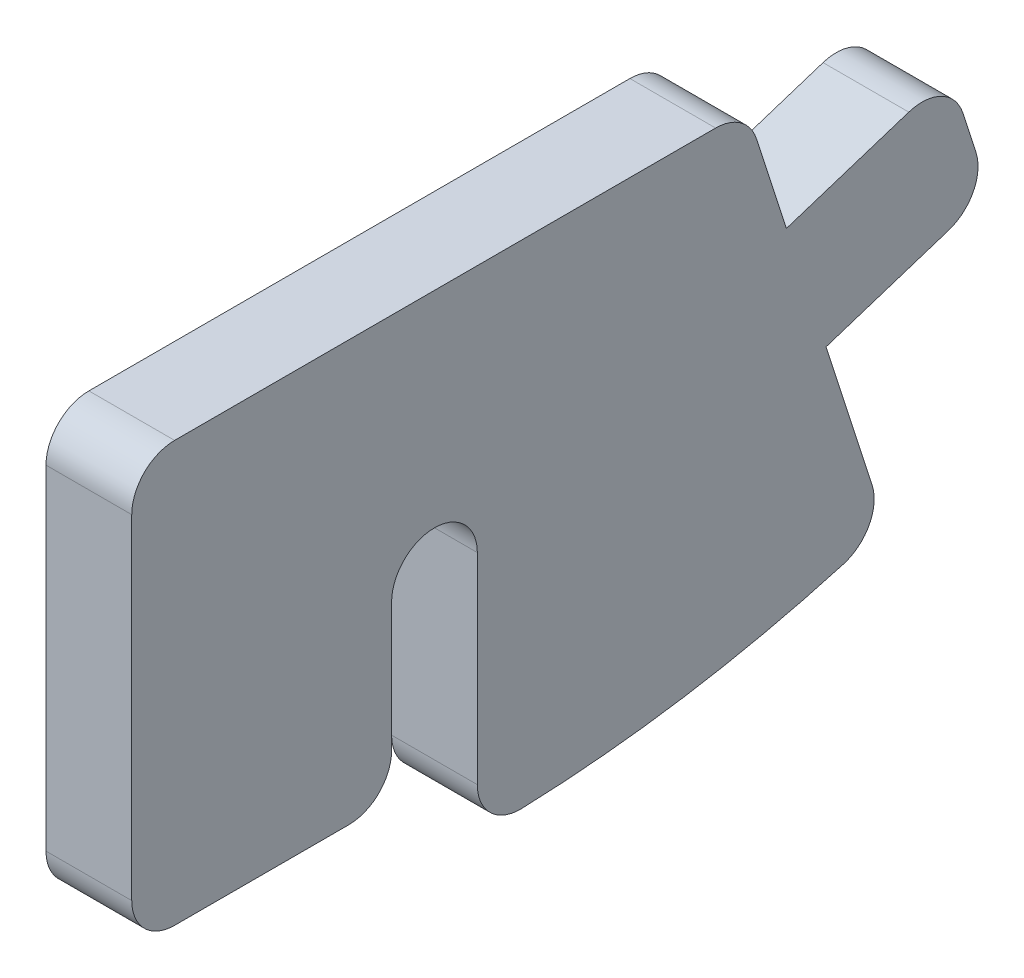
from build123d import *

# Parameters (mm, degrees)
RESSALTO_EXTRUS_O1_DEPTH = 2


with BuildPart() as part:
    # Esbo_o1 → Ressalto-extrus_o1 (new body)
    with BuildSketch(Plane(origin=(0, 0, 0), x_dir=(0, 0, -1), z_dir=(1, 0, 0))):
        with BuildLine():
            Line((1, 0), (13.619955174, 0))
            ThreePointArc((13.619955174, 0), (14.20826651, -0.191365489), (14.571412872, -0.692220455))
            Line((14.571412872, -0.692220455), (15.270830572, -2.854373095))
            Line((15.270830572, -2.854373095), (18.125203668, -1.931034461))
            ThreePointArc((18.125203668, -1.931034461), (18.8881324, -1.992076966), (19.384440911, -2.574712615))
            Line((19.384440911, -2.574712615), (19.692220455, -3.526170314))
            ThreePointArc((19.692220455, -3.526170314), (19.631177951, -4.289099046), (19.048542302, -4.785407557))
            Line((19.048542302, -4.785407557), (16.194169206, -5.708746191))
            Line((16.194169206, -5.708746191), (17.269391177, -9.032645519))
            ThreePointArc((17.269391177, -9.032645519), (17.200620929, -9.810385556), (16.593756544, -10.301633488))
            ThreePointArc((16.593756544, -10.301633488), (12.880660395, -11.123916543), (9.094724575, -11.484364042))
            ThreePointArc((9.094724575, -11.484364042), (8.366122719, -11.203742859), (8.061318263, -10.484922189))
            Line((8.061318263, -10.484922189), (8.061318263, -5.79672436))
            ThreePointArc((8.061318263, -5.79672436), (7.061318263, -4.79672436), (6.061318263, -5.79672436))
            Line((6.061318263, -5.79672436), (6.061318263, -8.79672436))
            ThreePointArc((6.061318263, -8.79672436), (5.768425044, -9.503831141), (5.061318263, -9.79672436))
            Line((5.061318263, -9.79672436), (1, -9.79672436))
            ThreePointArc((1, -9.79672436), (0.292893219, -9.503831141), (0, -8.79672436))
            Line((0, -8.79672436), (0, -1))
            ThreePointArc((0, -1), (0.292893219, -0.292893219), (1, 0))
        make_face()
    extrude(amount=RESSALTO_EXTRUS_O1_DEPTH)


solid = part.part
